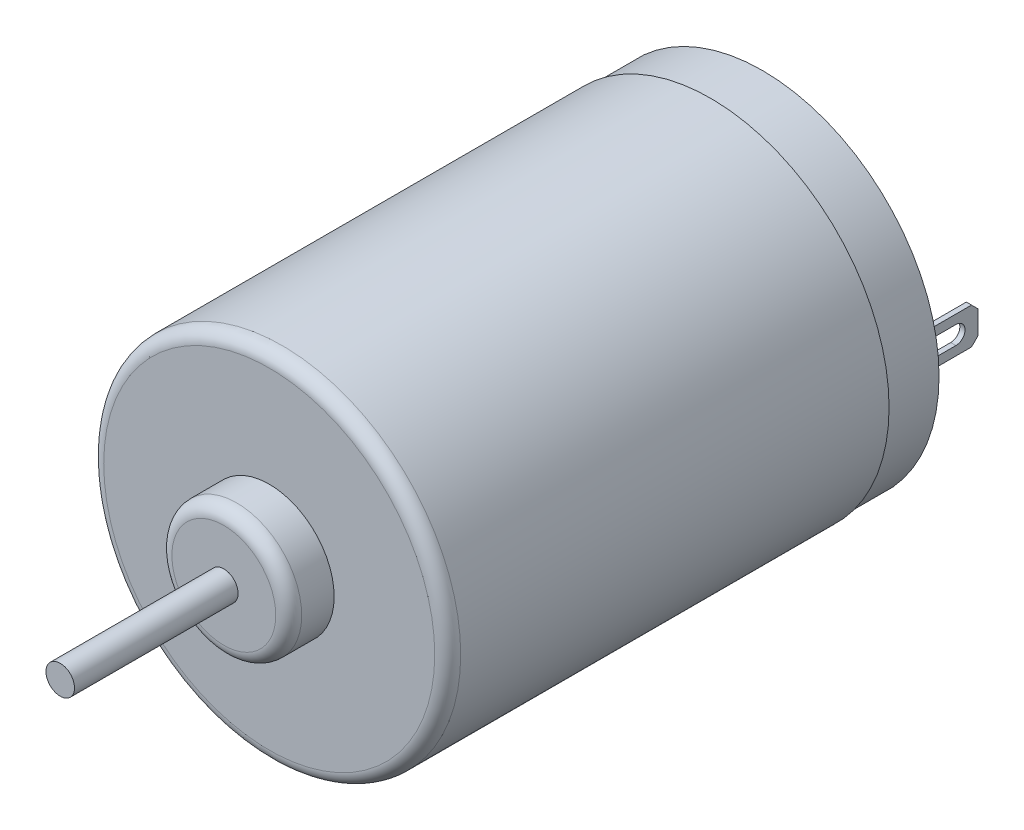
from build123d import *

# Parameters (mm, degrees)
ESQUISSE1_R             = 13.75
BOSS_EXTRU_1_DEPTH      = 34
ESQUISSE2_R             = 5
BOSS_EXTRU_2_DEPTH      = 3.5
ESQUISSE3_R             = 1.1
BOSS_EXTRU_3_DEPTH      = 12.6
ESQUISSE4_R             = 13.6
BOSS_EXTRU_4_DEPTH      = 4
ESQUISSE5_R             = 10.845491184
ESQUISSE5_R_2           = 6
ENL_V_MAT_EXTRU_1_DEPTH = 1
BOSS_EXTRU_5_START      = 2.2
ESQUISSE6_R             = 5
BOSS_EXTRU_5_DEPTH      = 2.2
BOSS_EXTRU_6_START      = 1
ESQUISSE7_R             = 1.1
BOSS_EXTRU_6_DEPTH      = 1
ESQUISSE8_W             = 0.4
ESQUISSE8_H             = 2.8
BOSS_EXTRU_7_DEPTH      = 5.1
ENL_V_MAT_EXTRU_2_DEPTH = 0.5
CONG_1_R                = 1


with BuildPart() as part:
    # Esquisse1 → Boss.-Extru.1 (new body)
    with BuildSketch(Plane.XY):
        Circle(ESQUISSE1_R)
    extrude(amount=BOSS_EXTRU_1_DEPTH)

    # Esquisse2 → Boss.-Extru.2 (add)
    with BuildSketch(Plane.XY.offset(34)):
        Circle(ESQUISSE2_R)
    extrude(amount=BOSS_EXTRU_2_DEPTH)

    # Esquisse3 → Boss.-Extru.3 (add)
    with BuildSketch(Plane.XY.offset(37.5)):
        Circle(ESQUISSE3_R)
    extrude(amount=BOSS_EXTRU_3_DEPTH)

    # Esquisse4 → Boss.-Extru.4 (add)
    with BuildSketch(Plane(origin=(0, 0, 0), x_dir=(-1, 0, 0), z_dir=(0, 0, -1))):
        with Locations(Location((0, 0, 0), (0, 0, 180))):
            Circle(ESQUISSE4_R)
    extrude(amount=BOSS_EXTRU_4_DEPTH)

    # Esquisse5 → Enl_v. mat.-Extru.1 (cut)
    with BuildSketch(Plane(origin=(0, 0, -4), x_dir=(-1, 0, 0), z_dir=(0, 0, -1))):
        Circle(ESQUISSE5_R)
        Circle(ESQUISSE5_R_2, mode=Mode.SUBTRACT)
    extrude(amount=-ENL_V_MAT_EXTRU_1_DEPTH, mode=Mode.SUBTRACT)

    # Esquisse6 → Boss.-Extru.5 (add)
    with BuildSketch(Plane(origin=(0, 0, -4), x_dir=(-1, 0, 0), z_dir=(0, 0, -1)).offset(BOSS_EXTRU_5_START)):
        with Locations(Location((0, 0, 0), (0, 0, 180))):
            Circle(ESQUISSE6_R)
    extrude(amount=-BOSS_EXTRU_5_DEPTH)

    # Esquisse7 → Boss.-Extru.6 (add)
    with BuildSketch(Plane(origin=(0, 0, -6.2), x_dir=(-1, 0, 0), z_dir=(0, 0, -1)).offset(BOSS_EXTRU_6_START)):
        with Locations(Location((0, 0, 0), (0, 0, 180))):
            Circle(ESQUISSE7_R)
    extrude(amount=-BOSS_EXTRU_6_DEPTH)

    # Esquisse8 → Boss.-Extru.7 (add)
    with BuildSketch(Plane(origin=(0, 0, -4), x_dir=(-1, 0, 0), z_dir=(0, 0, -1))):
        with Locations((-11.3, 0)):
            Rectangle(ESQUISSE8_W, ESQUISSE8_H)
    boss_extru_7 = extrude(amount=BOSS_EXTRU_7_DEPTH)

    # Esquisse9 → Enl_v. mat.-Extru.2 (cut)
    with BuildSketch(Plane(origin=(11.5, 0, 0), x_dir=(0, 0, -1), z_dir=(1, 0, 0))):
        with BuildLine():
            Line((5.8, 0.7), (7.4, 0.7))
            ThreePointArc((7.4, 0.7), (8.1, 0), (7.4, -0.7))
            Line((7.4, -0.7), (5.8, -0.7))
            ThreePointArc((5.8, -0.7), (5.1, 0), (5.8, 0.7))
        make_face()
        Polygon((8.6, 1.4), (9.1, 0.9), (9.1, 1.4), align=None)
        Polygon((9.1, -0.9), (9.1, -1.4), (8.6, -1.4), align=None)
    enl_v_mat_extru_2 = extrude(amount=-ENL_V_MAT_EXTRU_2_DEPTH, mode=Mode.SUBTRACT)

    # Cong_1
    cong_1_edges = [part.edges().sort_by_distance(p)[0] for p in [
        (-13.75, 0, 34),
        (-5, 0, 37.5),
    ]]
    fillet(cong_1_edges, radius=CONG_1_R)

    # Sym_trie1: Boss.-Extru.7, Enl_v. mat.-Extru.2 across plane
    add(boss_extru_7.mirror(Plane(origin=(0, 0, 0), x_dir=(0, 0, 1), z_dir=(1, 0, 0))))
    add(enl_v_mat_extru_2.mirror(Plane(origin=(0, 0, 0), x_dir=(0, 0, 1), z_dir=(1, 0, 0))), mode=Mode.SUBTRACT)


solid = part.part
